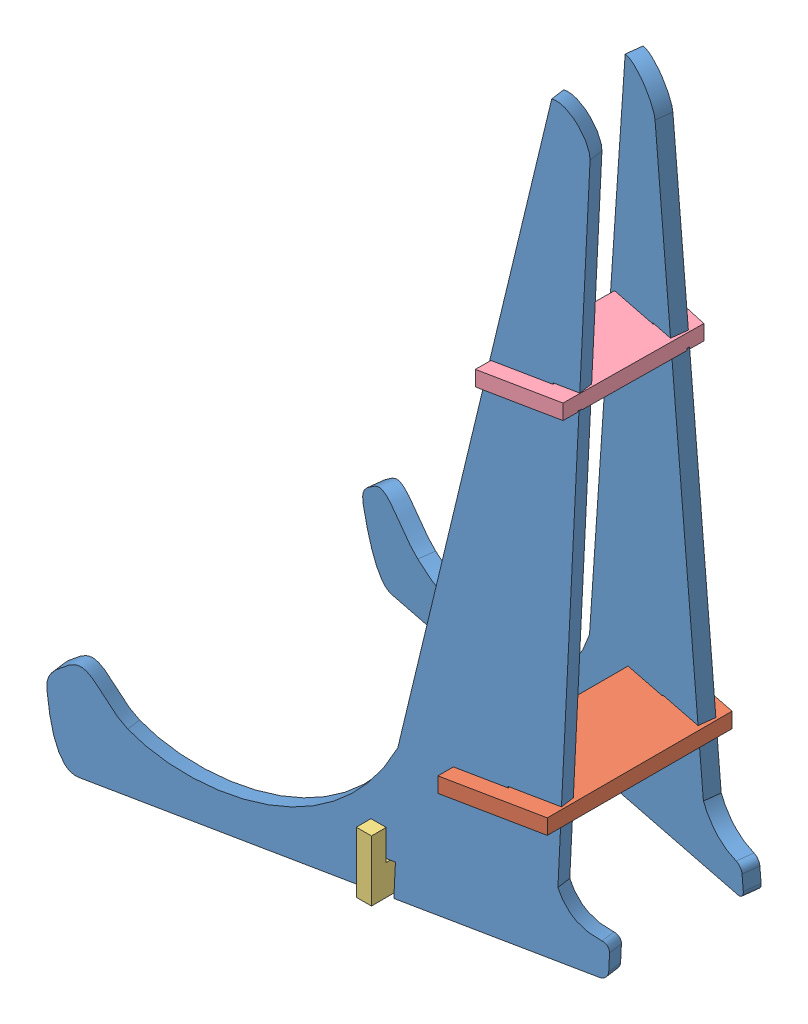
SolidWorks assembly Chevalet_Assemblage2.SLDASM, configuration Défaut (file format 10000). Lengths in mm.
Overall size (319.04 465.97 225.23).
5 component instances, 4 part files, 18 mates.
Components (placement in the parent):
- montant-1: montant.SLDPRT [Défaut] at (90.7161 -0.6761 40.4726) x (0.980401 0 -0.197014) z (0.196563 0.067615 0.978157) size (316.52 465.68 10)
- montant-2: montant.SLDPRT [Défaut] at (93.2292 0.6761 -50.2542) x (0.980401 0 0.197014) z (-0.196563 -0.067615 0.978157) size (316.52 465.68 10)
- plateau_bas-1: plateau_bas.SLDPRT [Défaut] at (63.0521 73.4478 74.9479) x (1 0 -0.000042) z (0 1 0) size (60 145.85 10)
- ecarteur-1: ecarteur.SLDPRT [Défaut] at (-29.2713 39.3239 -85.0861) x (0 -1 0) z (-0.999993 0 0.003607) size (40 170 10)
- plateau_haut-1: plateau_haut.SLDPRT [Défaut] at (58.3846 300.4739 65.1368) x (0.999938 0 0.011128) z (0 1 0) size (48 112.17 10)
Mates (geometry in assembly coordinates):
- Distance1: distance = 100 mm: plane of assembly through (0 0 0) normal (0 0 1); point of montant-1
- Distance2: distance = 40 mm: point of montant-1; plane of assembly
- Distance3: distance = 20 mm: point of montant-1; plane of assembly
- Coïncidente4: coincident: line of montant-1 through (-197.6096 0 108.5889) axis (0.980401 0 -0.197014); plane of assembly
- Distance4: distance = 20 mm: point of montant-2; plane of assembly
- Distance5: distance = 100 mm: point of montant-2; plane of assembly
- Distance6: distance = 40 mm: point of montant-2; plane of assembly
- Coïncidente8: coincident: line of montant-2 through (-26.3845 0 -64.1142) axis (0.980401 0 0.197014); plane of assembly
- Parallèle7: parallel aligned: plane of plateau_haut-1 through (58.3846 310.4739 65.1368) normal (0 1 0); plane of assembly through (0 0 0) normal (0 1 0)
- Coïncidente15: coincident: line of montant-1 through (57.1498 310.4739 25.7098) axis (-0.980401 0 0.197014); plane of plateau_haut-1 through (58.3846 310.4739 65.1368) normal (0 1 0)
- Coïncidente16: coincident: plane of montant-1 through (47.4918 454.9822 17.6615) normal (-0.196563 -0.067615 -0.978157); line of plateau_haut-1 through (42.6693 310.4739 28.6197) axis (-0.980401 0 0.197014)
- Parallèle8: parallel aligned: plane of plateau_bas-1 through (63.0521 83.4478 74.9479) normal (0 1 0); plane of plateau_haut-1 through (58.3846 310.4739 65.1368) normal (0 1 0)
- Coïncidente18: coincident: plane of montant-1 through (47.4918 454.9822 17.6615) normal (-0.196563 -0.067615 -0.978157); line of plateau_bas-1 through (31.0418 83.4478 46.6493) axis (-0.980401 0 0.197014)
- Coïncidente20: coincident: line of montant-1 through (60.1809 83.4478 40.7937) axis (-0.980401 0 0.197014); plane of plateau_bas-1 through (63.0521 83.4478 74.9479) normal (0 1 0)
- Parallèle11: parallel anti-aligned: plane of ecarteur-1 through (-39.2712 -0.6761 -85.05) normal (0 -1 0); plane of assembly through (0 0 0) normal (0 1 0)
- Coïncidente28: coincident: line of montant-1 through (-199.5752 -0.6761 98.8073) axis (0.980401 0 -0.197014); plane of ecarteur-1 through (-39.2712 -0.6761 -85.05) normal (0 -1 0)
- Coïncidente31: coincident: plane of montant-1 through (47.4918 454.9822 17.6615) normal (-0.196563 -0.067615 -0.978157); point of ecarteur-1
- Coïncidente32: coincident: point of montant-2; plane of ecarteur-1 through (-39.2712 39.3239 -85.05) normal (-0.999993 0 0.003607)
